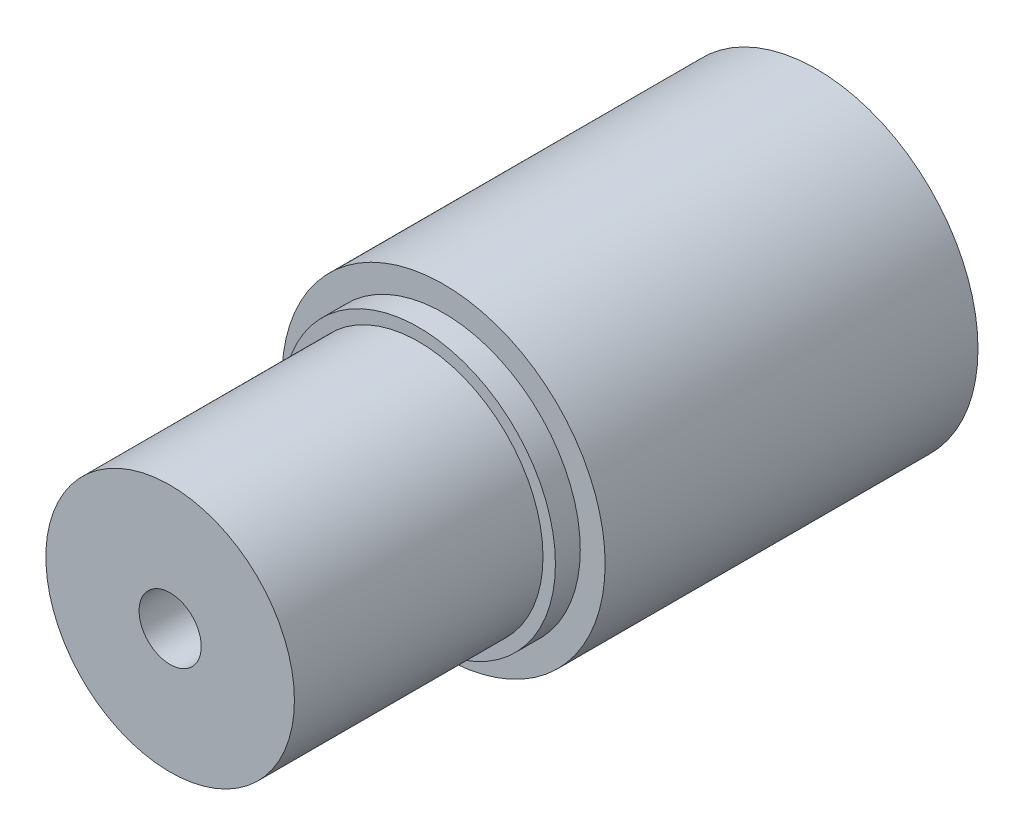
ISO-10303-21;
HEADER;
FILE_DESCRIPTION(('STEP AP214'),'2;1');
FILE_NAME('part.step','',(''),(''),'','','');
FILE_SCHEMA(('AUTOMOTIVE_DESIGN { 1 0 10303 214 1 1 1 1 }'));
ENDSEC;
DATA;
#1=APPLICATION_CONTEXT('core data for automotive mechanical design processes');
#2=APPLICATION_PROTOCOL_DEFINITION('international standard','automotive_design',2000,#1);
#3=PRODUCT_CONTEXT('',#1,'mechanical');
#4=PRODUCT('Part','Part','',(#3));
#5=PRODUCT_RELATED_PRODUCT_CATEGORY('part','',(#4));
#6=PRODUCT_DEFINITION_FORMATION('','',#4);
#7=PRODUCT_DEFINITION_CONTEXT('part definition',#1,'design');
#8=PRODUCT_DEFINITION('design','',#6,#7);
#9=PRODUCT_DEFINITION_SHAPE('','',#8);
#10=(LENGTH_UNIT() NAMED_UNIT(*) SI_UNIT(.MILLI.,.METRE.));
#11=(NAMED_UNIT(*) PLANE_ANGLE_UNIT() SI_UNIT($,.RADIAN.));
#12=(NAMED_UNIT(*) SI_UNIT($,.STERADIAN.) SOLID_ANGLE_UNIT());
#13=UNCERTAINTY_MEASURE_WITH_UNIT(LENGTH_MEASURE(1.E-05),#10,'distance_accuracy_value','');
#14=(GEOMETRIC_REPRESENTATION_CONTEXT(3) GLOBAL_UNCERTAINTY_ASSIGNED_CONTEXT((#13)) GLOBAL_UNIT_ASSIGNED_CONTEXT((#10,
#11,#12)) REPRESENTATION_CONTEXT('',''));
#15=CARTESIAN_POINT('',(0.,0.,0.));
#16=DIRECTION('',(0.,0.,1.));
#17=DIRECTION('',(1.,0.,0.));
#18=AXIS2_PLACEMENT_3D('',#15,#16,#17);
#19=CARTESIAN_POINT('',(0.,0.,30.));
#20=DIRECTION('',(0.,0.,1.));
#21=DIRECTION('',(1.,0.,0.));
#22=AXIS2_PLACEMENT_3D('',#19,#20,#21);
#23=PLANE('',#22);
#24=CARTESIAN_POINT('',(0.,0.,30.));
#25=DIRECTION('',(0.,0.,1.));
#26=DIRECTION('',(1.,0.,0.));
#27=AXIS2_PLACEMENT_3D('',#24,#25,#26);
#28=CIRCLE('',#27,13.);
#29=CARTESIAN_POINT('',(13.,0.,30.));
#30=VERTEX_POINT('',#29);
#31=EDGE_CURVE('E10',#30,#30,#28,.T.);
#32=ORIENTED_EDGE('',*,*,#31,.T.);
#33=EDGE_LOOP('',(#32));
#34=FACE_BOUND('',#33,.T.);
#35=CARTESIAN_POINT('',(0.,0.,30.));
#36=DIRECTION('',(0.,0.,1.));
#37=DIRECTION('',(1.,0.,0.));
#38=AXIS2_PLACEMENT_3D('',#35,#36,#37);
#39=CIRCLE('',#38,11.);
#40=CARTESIAN_POINT('',(11.,0.,30.));
#41=VERTEX_POINT('',#40);
#42=EDGE_CURVE('E41',#41,#41,#39,.T.);
#43=ORIENTED_EDGE('',*,*,#42,.F.);
#44=EDGE_LOOP('',(#43));
#45=FACE_BOUND('',#44,.T.);
#46=ADVANCED_FACE('F29',(#34,#45),#23,.T.);
#47=CARTESIAN_POINT('',(0.,0.,30.));
#48=DIRECTION('',(0.,0.,-1.));
#49=DIRECTION('',(-1.,0.,0.));
#50=AXIS2_PLACEMENT_3D('',#47,#48,#49);
#51=CYLINDRICAL_SURFACE('',#50,13.);
#52=ORIENTED_EDGE('',*,*,#31,.F.);
#53=EDGE_LOOP('',(#52));
#54=FACE_BOUND('',#53,.T.);
#55=CARTESIAN_POINT('',(0.,0.,0.));
#56=DIRECTION('',(0.,0.,1.));
#57=DIRECTION('',(1.,0.,0.));
#58=AXIS2_PLACEMENT_3D('',#55,#56,#57);
#59=CIRCLE('',#58,13.);
#60=CARTESIAN_POINT('',(13.,0.,0.));
#61=VERTEX_POINT('',#60);
#62=EDGE_CURVE('E37',#61,#61,#59,.T.);
#63=ORIENTED_EDGE('',*,*,#62,.T.);
#64=EDGE_LOOP('',(#63));
#65=FACE_BOUND('',#64,.T.);
#66=ADVANCED_FACE('F31',(#54,#65),#51,.T.);
#67=CARTESIAN_POINT('',(0.,0.,0.));
#68=DIRECTION('',(0.,0.,1.));
#69=DIRECTION('',(1.,0.,0.));
#70=AXIS2_PLACEMENT_3D('',#67,#68,#69);
#71=PLANE('',#70);
#72=CARTESIAN_POINT('',(0.,0.,0.));
#73=DIRECTION('',(0.,0.,-1.));
#74=DIRECTION('',(-1.,0.,0.));
#75=AXIS2_PLACEMENT_3D('',#72,#73,#74);
#76=CIRCLE('',#75,7.25);
#77=CARTESIAN_POINT('',(-7.25,0.,0.));
#78=VERTEX_POINT('',#77);
#79=EDGE_CURVE('E55',#78,#78,#76,.T.);
#80=ORIENTED_EDGE('',*,*,#79,.F.);
#81=EDGE_LOOP('',(#80));
#82=FACE_BOUND('',#81,.T.);
#83=ORIENTED_EDGE('',*,*,#62,.F.);
#84=EDGE_LOOP('',(#83));
#85=FACE_BOUND('',#84,.T.);
#86=ADVANCED_FACE('F83',(#82,#85),#71,.F.);
#87=CARTESIAN_POINT('',(0.,0.,52.));
#88=DIRECTION('',(0.,0.,1.));
#89=DIRECTION('',(1.,0.,0.));
#90=AXIS2_PLACEMENT_3D('',#87,#88,#89);
#91=CYLINDRICAL_SURFACE('',#90,11.);
#92=CARTESIAN_POINT('',(0.,0.,32.));
#93=DIRECTION('',(0.,0.,1.));
#94=DIRECTION('',(1.,0.,0.));
#95=AXIS2_PLACEMENT_3D('',#92,#93,#94);
#96=CIRCLE('',#95,11.);
#97=CARTESIAN_POINT('',(11.,0.,32.));
#98=VERTEX_POINT('',#97);
#99=EDGE_CURVE('E46',#98,#98,#96,.T.);
#100=ORIENTED_EDGE('',*,*,#99,.F.);
#101=EDGE_LOOP('',(#100));
#102=FACE_BOUND('',#101,.T.);
#103=ORIENTED_EDGE('',*,*,#42,.T.);
#104=EDGE_LOOP('',(#103));
#105=FACE_BOUND('',#104,.T.);
#106=ADVANCED_FACE('F89',(#102,#105),#91,.T.);
#107=CARTESIAN_POINT('',(0.,11.,32.));
#108=DIRECTION('',(0.,0.,-1.));
#109=DIRECTION('',(-1.,0.,0.));
#110=AXIS2_PLACEMENT_3D('',#107,#108,#109);
#111=PLANE('',#110);
#112=CARTESIAN_POINT('',(0.,0.,32.));
#113=DIRECTION('',(0.,0.,1.));
#114=DIRECTION('',(1.,0.,0.));
#115=AXIS2_PLACEMENT_3D('',#112,#113,#114);
#116=CIRCLE('',#115,10.);
#117=CARTESIAN_POINT('',(10.,0.,32.));
#118=VERTEX_POINT('',#117);
#119=EDGE_CURVE('E49',#118,#118,#116,.T.);
#120=ORIENTED_EDGE('',*,*,#119,.F.);
#121=EDGE_LOOP('',(#120));
#122=FACE_BOUND('',#121,.T.);
#123=ORIENTED_EDGE('',*,*,#99,.T.);
#124=EDGE_LOOP('',(#123));
#125=FACE_BOUND('',#124,.T.);
#126=ADVANCED_FACE('F93',(#122,#125),#111,.F.);
#127=CARTESIAN_POINT('',(0.,0.,52.));
#128=DIRECTION('',(0.,0.,1.));
#129=DIRECTION('',(1.,0.,0.));
#130=AXIS2_PLACEMENT_3D('',#127,#128,#129);
#131=CYLINDRICAL_SURFACE('',#130,10.);
#132=CARTESIAN_POINT('',(0.,0.,52.));
#133=DIRECTION('',(0.,0.,1.));
#134=DIRECTION('',(1.,0.,0.));
#135=AXIS2_PLACEMENT_3D('',#132,#133,#134);
#136=CIRCLE('',#135,10.);
#137=CARTESIAN_POINT('',(10.,0.,52.));
#138=VERTEX_POINT('',#137);
#139=EDGE_CURVE('E52',#138,#138,#136,.T.);
#140=ORIENTED_EDGE('',*,*,#139,.F.);
#141=EDGE_LOOP('',(#140));
#142=FACE_BOUND('',#141,.T.);
#143=ORIENTED_EDGE('',*,*,#119,.T.);
#144=EDGE_LOOP('',(#143));
#145=FACE_BOUND('',#144,.T.);
#146=ADVANCED_FACE('F97',(#142,#145),#131,.T.);
#147=CARTESIAN_POINT('',(0.,10.,52.));
#148=DIRECTION('',(0.,0.,-1.));
#149=DIRECTION('',(-1.,0.,0.));
#150=AXIS2_PLACEMENT_3D('',#147,#148,#149);
#151=PLANE('',#150);
#152=CARTESIAN_POINT('',(0.,0.,52.));
#153=DIRECTION('',(0.,0.,1.));
#154=DIRECTION('',(1.,0.,0.));
#155=AXIS2_PLACEMENT_3D('',#152,#153,#154);
#156=CIRCLE('',#155,2.49999999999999);
#157=CARTESIAN_POINT('',(2.49999999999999,0.,52.));
#158=VERTEX_POINT('',#157);
#159=EDGE_CURVE('E61',#158,#158,#156,.T.);
#160=ORIENTED_EDGE('',*,*,#159,.F.);
#161=EDGE_LOOP('',(#160));
#162=FACE_BOUND('',#161,.T.);
#163=ORIENTED_EDGE('',*,*,#139,.T.);
#164=EDGE_LOOP('',(#163));
#165=FACE_BOUND('',#164,.T.);
#166=ADVANCED_FACE('F101',(#162,#165),#151,.F.);
#167=CARTESIAN_POINT('',(0.,0.,0.));
#168=DIRECTION('',(0.,0.,-1.));
#169=DIRECTION('',(-1.,0.,0.));
#170=AXIS2_PLACEMENT_3D('',#167,#168,#169);
#171=CYLINDRICAL_SURFACE('',#170,7.25);
#172=CARTESIAN_POINT('',(0.,0.,12.));
#173=DIRECTION('',(0.,0.,-1.));
#174=DIRECTION('',(-1.,0.,0.));
#175=AXIS2_PLACEMENT_3D('',#172,#173,#174);
#176=CIRCLE('',#175,7.25);
#177=CARTESIAN_POINT('',(-7.25,0.,12.));
#178=VERTEX_POINT('',#177);
#179=EDGE_CURVE('E58',#178,#178,#176,.T.);
#180=ORIENTED_EDGE('',*,*,#179,.F.);
#181=EDGE_LOOP('',(#180));
#182=FACE_BOUND('',#181,.T.);
#183=ORIENTED_EDGE('',*,*,#79,.T.);
#184=EDGE_LOOP('',(#183));
#185=FACE_BOUND('',#184,.T.);
#186=ADVANCED_FACE('F77',(#182,#185),#171,.F.);
#187=CARTESIAN_POINT('',(0.,0.,12.));
#188=DIRECTION('',(0.,0.,-1.));
#189=DIRECTION('',(-1.,0.,0.));
#190=AXIS2_PLACEMENT_3D('',#187,#188,#189);
#191=CONICAL_SURFACE('',#190,7.25,1.02974425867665);
#192=CARTESIAN_POINT('',(0.,0.,14.8540879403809));
#193=DIRECTION('',(0.,0.,-1.));
#194=DIRECTION('',(-1.,0.,0.));
#195=AXIS2_PLACEMENT_3D('',#192,#193,#194);
#196=CIRCLE('',#195,2.49999999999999);
#197=CARTESIAN_POINT('',(-2.49999999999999,0.,14.8540879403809));
#198=VERTEX_POINT('',#197);
#199=EDGE_CURVE('E33',#198,#198,#196,.F.);
#200=ORIENTED_EDGE('',*,*,#199,.T.);
#201=EDGE_LOOP('',(#200));
#202=FACE_BOUND('',#201,.T.);
#203=ORIENTED_EDGE('',*,*,#179,.T.);
#204=EDGE_LOOP('',(#203));
#205=FACE_BOUND('',#204,.T.);
#206=ADVANCED_FACE('F68',(#202,#205),#191,.F.);
#207=CARTESIAN_POINT('',(0.,0.,52.));
#208=DIRECTION('',(0.,0.,1.));
#209=DIRECTION('',(1.,0.,0.));
#210=AXIS2_PLACEMENT_3D('',#207,#208,#209);
#211=CYLINDRICAL_SURFACE('',#210,2.49999999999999);
#212=ORIENTED_EDGE('',*,*,#159,.T.);
#213=EDGE_LOOP('',(#212));
#214=FACE_BOUND('',#213,.T.);
#215=ORIENTED_EDGE('',*,*,#199,.F.);
#216=EDGE_LOOP('',(#215));
#217=FACE_BOUND('',#216,.T.);
#218=ADVANCED_FACE('F71',(#214,#217),#211,.F.);
#219=CLOSED_SHELL('',(#46,#66,#86,#106,#126,#146,#166,#186,#206,#218));
#220=MANIFOLD_SOLID_BREP('B2',#219);
#221=ADVANCED_BREP_SHAPE_REPRESENTATION('',(#18,#220),#14);
#222=SHAPE_DEFINITION_REPRESENTATION(#9,#221);
ENDSEC;
END-ISO-10303-21;
